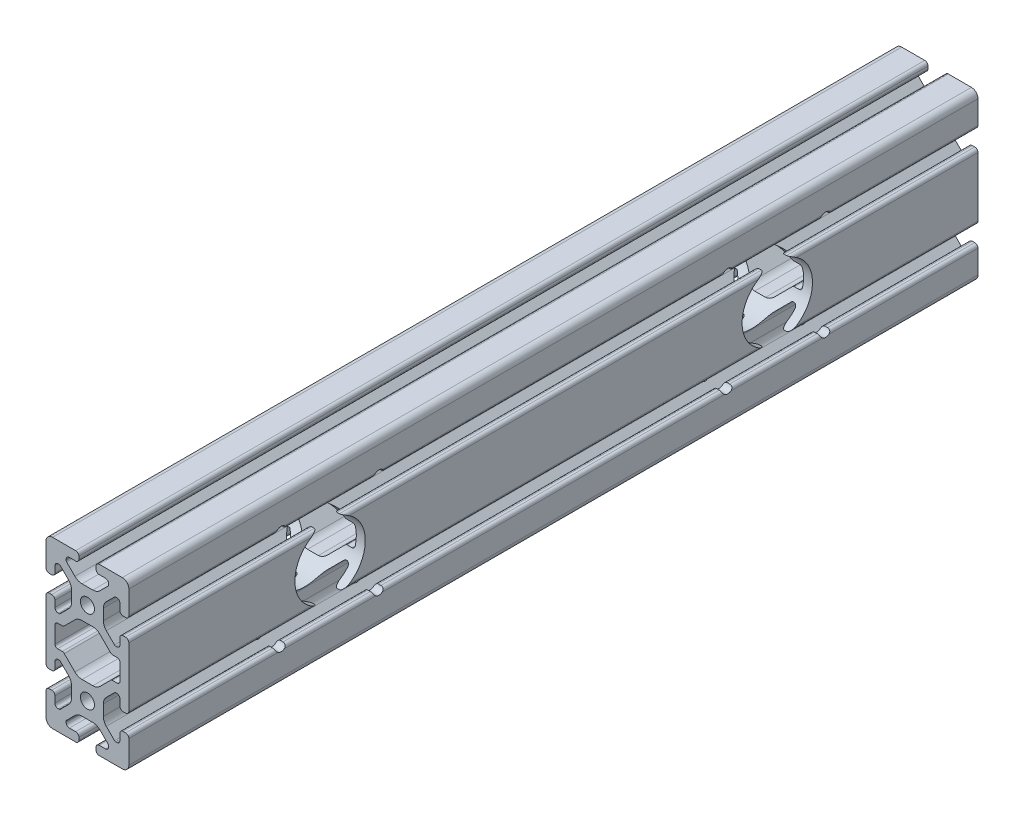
from build123d import *

# Parameters (mm, degrees)
SKETCH1_R           = 3.405
BOSS_EXTRUDE1_DEPTH = 3048
SKETCH26_W          = 40
SKETCH26_H          = 80.80011746
CUT_EXTRUDE1_DEPTH  = 2287.874723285
SKETCH33_W          = 40
SKETCH33_H          = 80.80011746
CUT_EXTRUDE2_DEPTH  = 1526.311771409
SKETCH41_W          = 40
SKETCH41_H          = 80.80011746
CUT_EXTRUDE3_DEPTH  = 1116.83781704
SKETCH54_R          = 17
CUT_EXTRUDE4_DEPTH  = 1936.299927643
SKETCH55_R          = 2.6
CUT_EXTRUDE5_DEPTH  = 1936.299927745


with BuildPart() as part:
    # Sketch1 → Boss-Extrude1 (new body)
    with BuildSketch(Plane(origin=(0, 0, -3048), x_dir=(-1, 0, 0), z_dir=(0, 0, -1))):
        with BuildLine():
            Line((16.83, 60), (5.69044933, 60))
            ThreePointArc((5.69044933, 60), (4.580291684, 59.540157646), (4.12044933, 58.43))
            Line((4.12044933, 58.43), (4.12044933, 57.25))
            ThreePointArc((4.12044933, 57.25), (4.580291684, 56.139842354), (5.69044933, 55.68))
            Line((5.69044933, 55.68), (8.7153995, 55.68))
            ThreePointArc((8.7153995, 55.68), (9.825557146, 55.220157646), (10.2853995, 54.11))
            Line((10.2853995, 54.11), (10.2853995, 53.654903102))
            ThreePointArc((10.2853995, 53.654903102), (10.227547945, 53.364063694), (10.062800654, 53.117501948))
            Line((10.062800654, 53.117501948), (6.055092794, 49.109794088))
            ThreePointArc((6.055092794, 49.109794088), (4.47691877, 48.055291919), (2.615335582, 47.685))
            Line((2.615335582, 47.685), (-2.615335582, 47.685))
            ThreePointArc((-2.615335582, 47.685), (-4.47691877, 48.055291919), (-6.055092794, 49.109794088))
            Line((-6.055092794, 49.109794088), (-10.062800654, 53.117501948))
            ThreePointArc((-10.062800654, 53.117501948), (-10.227547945, 53.364063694), (-10.2853995, 53.654903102))
            Line((-10.2853995, 53.654903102), (-10.2853995, 54.11))
            ThreePointArc((-10.2853995, 54.11), (-9.825557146, 55.220157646), (-8.7153995, 55.68))
            Line((-8.7153995, 55.68), (-5.69044933, 55.68))
            ThreePointArc((-5.69044933, 55.68), (-4.580291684, 56.139842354), (-4.12044933, 57.25))
            Line((-4.12044933, 57.25), (-4.12044933, 58.43))
            ThreePointArc((-4.12044933, 58.43), (-4.580291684, 59.540157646), (-5.69044933, 60))
            Line((-5.69044933, 60), (-16.83, 60))
            ThreePointArc((-16.83, 60), (-19.071528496, 59.071528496), (-20, 56.83))
            Line((-20, 56.83), (-20, 45.69044933))
            ThreePointArc((-20, 45.69044933), (-19.540157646, 44.580291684), (-18.43, 44.12044933))
            Line((-18.43, 44.12044933), (-17.25, 44.12044933))
            ThreePointArc((-17.25, 44.12044933), (-16.139842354, 44.580291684), (-15.68, 45.69044933))
            Line((-15.68, 45.69044933), (-15.68, 48.7153995))
            ThreePointArc((-15.68, 48.7153995), (-15.220157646, 49.825557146), (-14.11, 50.2853995))
            Line((-14.11, 50.2853995), (-13.652670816, 50.2853995))
            ThreePointArc((-13.652670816, 50.2853995), (-13.361831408, 50.227547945), (-13.115269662, 50.062800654))
            Line((-13.115269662, 50.062800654), (-9.109794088, 46.05732508))
            ThreePointArc((-9.109794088, 46.05732508), (-8.055291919, 44.479151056), (-7.685, 42.617567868))
            Line((-7.685, 42.617567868), (-7.685, 37.384664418))
            ThreePointArc((-7.685, 37.384664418), (-8.055291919, 35.52308123), (-9.109794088, 33.944907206))
            Line((-9.109794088, 33.944907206), (-13.117501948, 29.937199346))
            ThreePointArc((-13.117501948, 29.937199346), (-13.364063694, 29.772452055), (-13.654903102, 29.7146005))
            Line((-13.654903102, 29.7146005), (-14.11, 29.7146005))
            ThreePointArc((-14.11, 29.7146005), (-15.220157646, 30.174442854), (-15.68, 31.2846005))
            Line((-15.68, 31.2846005), (-15.68, 34.30955067))
            ThreePointArc((-15.68, 34.30955067), (-16.139842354, 35.419708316), (-17.25, 35.87955067))
            Line((-17.25, 35.87955067), (-18.43, 35.87955067))
            ThreePointArc((-18.43, 35.87955067), (-19.540157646, 35.419708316), (-20, 34.30955067))
            Line((-20, 34.30955067), (-20, 5.69044933))
            ThreePointArc((-20, 5.69044933), (-19.540157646, 4.580291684), (-18.43, 4.12044933))
            Line((-18.43, 4.12044933), (-17.25, 4.12044933))
            ThreePointArc((-17.25, 4.12044933), (-16.139842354, 4.580291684), (-15.68, 5.69044933))
            Line((-15.68, 5.69044933), (-15.68, 8.7153995))
            ThreePointArc((-15.68, 8.7153995), (-15.220157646, 9.825557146), (-14.11, 10.2853995))
            Line((-14.11, 10.2853995), (-13.654903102, 10.2853995))
            ThreePointArc((-13.654903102, 10.2853995), (-13.364063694, 10.227547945), (-13.117501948, 10.062800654))
            Line((-13.117501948, 10.062800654), (-9.109794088, 6.055092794))
            ThreePointArc((-9.109794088, 6.055092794), (-8.055291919, 4.47691877), (-7.685, 2.615335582))
            Line((-7.685, 2.615335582), (-7.685, -2.615335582))
            ThreePointArc((-7.685, -2.615335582), (-8.055291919, -4.47691877), (-9.109794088, -6.055092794))
            Line((-9.109794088, -6.055092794), (-13.117501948, -10.062800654))
            ThreePointArc((-13.117501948, -10.062800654), (-13.364063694, -10.227547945), (-13.654903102, -10.2853995))
            Line((-13.654903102, -10.2853995), (-14.11, -10.2853995))
            ThreePointArc((-14.11, -10.2853995), (-15.220157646, -9.825557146), (-15.68, -8.7153995))
            Line((-15.68, -8.7153995), (-15.68, -5.69044933))
            ThreePointArc((-15.68, -5.69044933), (-16.139842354, -4.580291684), (-17.25, -4.12044933))
            Line((-17.25, -4.12044933), (-18.43, -4.12044933))
            ThreePointArc((-18.43, -4.12044933), (-19.540157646, -4.580291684), (-20, -5.69044933))
            Line((-20, -5.69044933), (-20, -16.83))
            ThreePointArc((-20, -16.83), (-19.071528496, -19.071528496), (-16.83, -20))
            Line((-16.83, -20), (-5.69044933, -20))
            ThreePointArc((-5.69044933, -20), (-4.580291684, -19.540157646), (-4.12044933, -18.43))
            Line((-4.12044933, -18.43), (-4.12044933, -17.25))
            ThreePointArc((-4.12044933, -17.25), (-4.580291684, -16.139842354), (-5.69044933, -15.68))
            Line((-5.69044933, -15.68), (-8.7153995, -15.68))
            ThreePointArc((-8.7153995, -15.68), (-9.825557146, -15.220157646), (-10.2853995, -14.11))
            Line((-10.2853995, -14.11), (-10.2853995, -13.654903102))
            ThreePointArc((-10.2853995, -13.654903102), (-10.227547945, -13.364063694), (-10.062800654, -13.117501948))
            Line((-10.062800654, -13.117501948), (-6.055092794, -9.109794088))
            ThreePointArc((-6.055092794, -9.109794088), (-4.47691877, -8.055291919), (-2.615335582, -7.685))
            Line((-2.615335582, -7.685), (2.615335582, -7.685))
            ThreePointArc((2.615335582, -7.685), (4.47691877, -8.055291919), (6.055092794, -9.109794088))
            Line((6.055092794, -9.109794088), (10.062800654, -13.117501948))
            ThreePointArc((10.062800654, -13.117501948), (10.227547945, -13.364063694), (10.2853995, -13.654903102))
            Line((10.2853995, -13.654903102), (10.2853995, -14.11))
            ThreePointArc((10.2853995, -14.11), (9.825557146, -15.220157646), (8.7153995, -15.68))
            Line((8.7153995, -15.68), (5.69044933, -15.68))
            ThreePointArc((5.69044933, -15.68), (4.580291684, -16.139842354), (4.12044933, -17.25))
            Line((4.12044933, -17.25), (4.12044933, -18.43))
            ThreePointArc((4.12044933, -18.43), (4.580291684, -19.540157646), (5.69044933, -20))
            Line((5.69044933, -20), (16.83, -20))
            ThreePointArc((16.83, -20), (19.071528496, -19.071528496), (20, -16.83))
            Line((20, -16.83), (20, -5.69044933))
            ThreePointArc((20, -5.69044933), (19.540157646, -4.580291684), (18.43, -4.12044933))
            Line((18.43, -4.12044933), (17.25, -4.12044933))
            ThreePointArc((17.25, -4.12044933), (16.139842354, -4.580291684), (15.68, -5.69044933))
            Line((15.68, -5.69044933), (15.68, -8.7153995))
            ThreePointArc((15.68, -8.7153995), (15.220157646, -9.825557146), (14.11, -10.2853995))
            Line((14.11, -10.2853995), (13.654903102, -10.2853995))
            ThreePointArc((13.654903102, -10.2853995), (13.364063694, -10.227547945), (13.117501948, -10.062800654))
            Line((13.117501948, -10.062800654), (9.109794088, -6.055092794))
            ThreePointArc((9.109794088, -6.055092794), (8.055291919, -4.47691877), (7.685, -2.615335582))
            Line((7.685, -2.615335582), (7.685, 2.615335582))
            ThreePointArc((7.685, 2.615335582), (8.055291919, 4.47691877), (9.109794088, 6.055092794))
            Line((9.109794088, 6.055092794), (13.117501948, 10.062800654))
            ThreePointArc((13.117501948, 10.062800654), (13.364063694, 10.227547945), (13.654903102, 10.2853995))
            Line((13.654903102, 10.2853995), (14.11, 10.2853995))
            ThreePointArc((14.11, 10.2853995), (15.220157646, 9.825557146), (15.68, 8.7153995))
            Line((15.68, 8.7153995), (15.68, 5.69044933))
            ThreePointArc((15.68, 5.69044933), (16.139842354, 4.580291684), (17.25, 4.12044933))
            Line((17.25, 4.12044933), (18.43, 4.12044933))
            ThreePointArc((18.43, 4.12044933), (19.540157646, 4.580291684), (20, 5.69044933))
            Line((20, 5.69044933), (20, 34.30955067))
            ThreePointArc((20, 34.30955067), (19.540157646, 35.419708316), (18.43, 35.87955067))
            Line((18.43, 35.87955067), (17.25, 35.87955067))
            ThreePointArc((17.25, 35.87955067), (16.139842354, 35.419708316), (15.68, 34.30955067))
            Line((15.68, 34.30955067), (15.68, 31.2846005))
            ThreePointArc((15.68, 31.2846005), (15.220157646, 30.174442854), (14.11, 29.7146005))
            Line((14.11, 29.7146005), (13.654903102, 29.7146005))
            ThreePointArc((13.654903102, 29.7146005), (13.364063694, 29.772452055), (13.117501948, 29.937199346))
            Line((13.117501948, 29.937199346), (9.109794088, 33.944907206))
            ThreePointArc((9.109794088, 33.944907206), (8.055291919, 35.52308123), (7.685, 37.384664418))
            Line((7.685, 37.384664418), (7.685, 42.615335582))
            ThreePointArc((7.685, 42.615335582), (8.055291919, 44.47691877), (9.109794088, 46.055092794))
            Line((9.109794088, 46.055092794), (13.117501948, 50.062800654))
            ThreePointArc((13.117501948, 50.062800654), (13.364063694, 50.227547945), (13.654903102, 50.2853995))
            Line((13.654903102, 50.2853995), (14.11, 50.2853995))
            ThreePointArc((14.11, 50.2853995), (15.220157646, 49.825557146), (15.68, 48.7153995))
            Line((15.68, 48.7153995), (15.68, 45.69044933))
            ThreePointArc((15.68, 45.69044933), (16.139842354, 44.580291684), (17.25, 44.12044933))
            Line((17.25, 44.12044933), (18.43, 44.12044933))
            ThreePointArc((18.43, 44.12044933), (19.540157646, 44.580291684), (20, 45.69044933))
            Line((20, 45.69044933), (20, 56.83))
            ThreePointArc((20, 56.83), (19.071528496, 59.071528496), (16.83, 60))
        make_face()
        with Locations(Location((0, 0, 0), (0, 0, 180))):
            Circle(SKETCH1_R, mode=Mode.SUBTRACT)
        with Locations(Location((0, 40, 0), (0, 0, 180))):
            Circle(SKETCH1_R, mode=Mode.SUBTRACT)
        with BuildLine():
            Line((14.41, 14.65864833), (12.129998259, 14.65864833))
            ThreePointArc((12.129998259, 14.65864833), (11.608780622, 14.546764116), (11.179399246, 14.230824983))
            Line((11.179399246, 14.230824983), (6.055092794, 9.109794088))
            ThreePointArc((6.055092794, 9.109794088), (4.47691877, 8.055291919), (2.615335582, 7.685))
            Line((2.615335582, 7.685), (-2.615335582, 7.685))
            ThreePointArc((-2.615335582, 7.685), (-4.47691877, 8.055291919), (-6.055092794, 9.109794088))
            Line((-6.055092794, 9.109794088), (-11.231972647, 14.286673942))
            ThreePointArc((-11.231972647, 14.286673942), (-11.6439903, 14.561975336), (-12.129998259, 14.65864833))
            Line((-12.129998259, 14.65864833), (-14.41, 14.65864833))
            ThreePointArc((-14.41, 14.65864833), (-15.308025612, 15.030622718), (-15.68, 15.92864833))
            Line((-15.68, 15.92864833), (-15.68, 24.07135167))
            ThreePointArc((-15.68, 24.07135167), (-15.308025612, 24.969377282), (-14.41, 25.34135167))
            Line((-14.41, 25.34135167), (-12.129998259, 25.34135167))
            ThreePointArc((-12.129998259, 25.34135167), (-11.6439903, 25.438024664), (-11.231972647, 25.713326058))
            Line((-11.231972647, 25.713326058), (-6.055092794, 30.890205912))
            ThreePointArc((-6.055092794, 30.890205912), (-4.47691877, 31.944708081), (-2.615335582, 32.315))
            Line((-2.615335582, 32.315), (2.617567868, 32.315))
            ThreePointArc((2.617567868, 32.315), (4.479151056, 31.944708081), (6.05732508, 30.890205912))
            Line((6.05732508, 30.890205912), (11.184160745, 25.763370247))
            ThreePointArc((11.184160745, 25.763370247), (11.612140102, 25.451641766), (12.129998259, 25.34135167))
            Line((12.129998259, 25.34135167), (14.41, 25.34135167))
            ThreePointArc((14.41, 25.34135167), (15.308025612, 24.969377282), (15.68, 24.07135167))
            Line((15.68, 24.07135167), (15.68, 15.92864833))
            ThreePointArc((15.68, 15.92864833), (15.308025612, 15.030622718), (14.41, 14.65864833))
        make_face(mode=Mode.SUBTRACT)
    extrude(amount=-BOSS_EXTRUDE1_DEPTH)

    # Sketch26 → Cut-Extrude1 (cut, through all)
    with BuildSketch(Plane.XY.offset(-762)):
        with Locations((0, 19.59994127)):
            Rectangle(SKETCH26_W, SKETCH26_H)
    extrude(amount=CUT_EXTRUDE1_DEPTH, mode=Mode.SUBTRACT)

    # Sketch33 → Cut-Extrude2 (cut, through all)
    with BuildSketch(Plane.XY.offset(-1524)):
        with Locations((0, 19.59994127)):
            Rectangle(SKETCH33_W, SKETCH33_H)
    extrude(amount=CUT_EXTRUDE2_DEPTH, mode=Mode.SUBTRACT)

    # Sketch41 → Cut-Extrude3 (cut, through all)
    with BuildSketch(Plane.XY.offset(-1933.956)):
        with Locations((0, 19.59994127)):
            Rectangle(SKETCH41_W, SKETCH41_H)
    extrude(amount=-CUT_EXTRUDE3_DEPTH, mode=Mode.SUBTRACT)

    # Sketch54 → Cut-Extrude4 (cut, through all)
    with BuildSketch(Plane.ZY.offset(20)):
        with Locations(Location((-1621.15, 20, 0), (0, 0, 249.081817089))):
            Circle(SKETCH54_R)
        with Locations(Location((-1837.05, 20, 0), (0, 0, 290.918182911))):
            Circle(SKETCH54_R)
    extrude(amount=-CUT_EXTRUDE4_DEPTH, mode=Mode.SUBTRACT)

    # Sketch55 → Cut-Extrude5 (cut, through all)
    with BuildSketch(Plane.ZY.offset(20)):
        with Locations(Location((-1644.72, -3.57, 0), (0, 0, 252.902320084))):
            Circle(SKETCH55_R)
        with Locations(Location((-1597.476, -3.57, 0), (0, 0, 252.902320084))):
            Circle(SKETCH55_R)
        with Locations(Location((-1597.476, 43.670000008, 0), (0, 0, 203.931249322))):
            Circle(SKETCH55_R)
        with Locations(Location((-1644.72, 43.670000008, 0), (0, 0, 203.931249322))):
            Circle(SKETCH55_R)
        with Locations(Location((-1813.132, -3.57, 0), (0, 0, 252.902320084))):
            Circle(SKETCH55_R)
        with Locations(Location((-1860.376, -3.57, 0), (0, 0, 252.902320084))):
            Circle(SKETCH55_R)
        with Locations(Location((-1813.132, 43.670000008, 0), (0, 0, 336.068750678))):
            Circle(SKETCH55_R)
        with Locations(Location((-1860.376, 43.670000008, 0), (0, 0, 336.068750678))):
            Circle(SKETCH55_R)
    extrude(amount=-CUT_EXTRUDE5_DEPTH, mode=Mode.SUBTRACT)


solid = part.part
